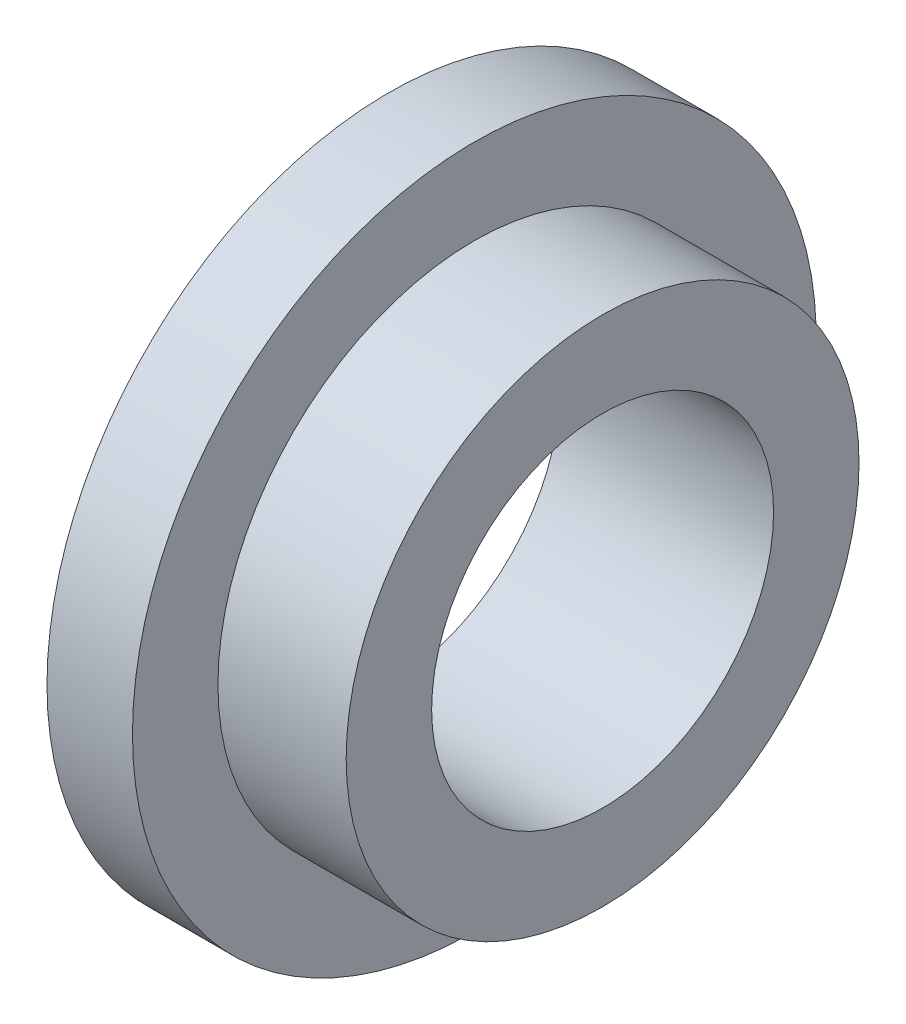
from build123d import *


with BuildPart() as part:
    # Sketch1 → Revolve1 (revolve)
    with BuildSketch(Plane.XY, mode=Mode.PRIVATE) as revolve1_sk:
        Polygon((0, 8), (0, 4), (5, 4), (5, 6), (2, 6), (2, 8), align=None)
    revolve(revolve1_sk.sketch.rotate(Axis((0, 0, 0), (1, 0, 0)), 90), axis=Axis((0, 0, 0), (1, 0, 0)))


solid = part.part
